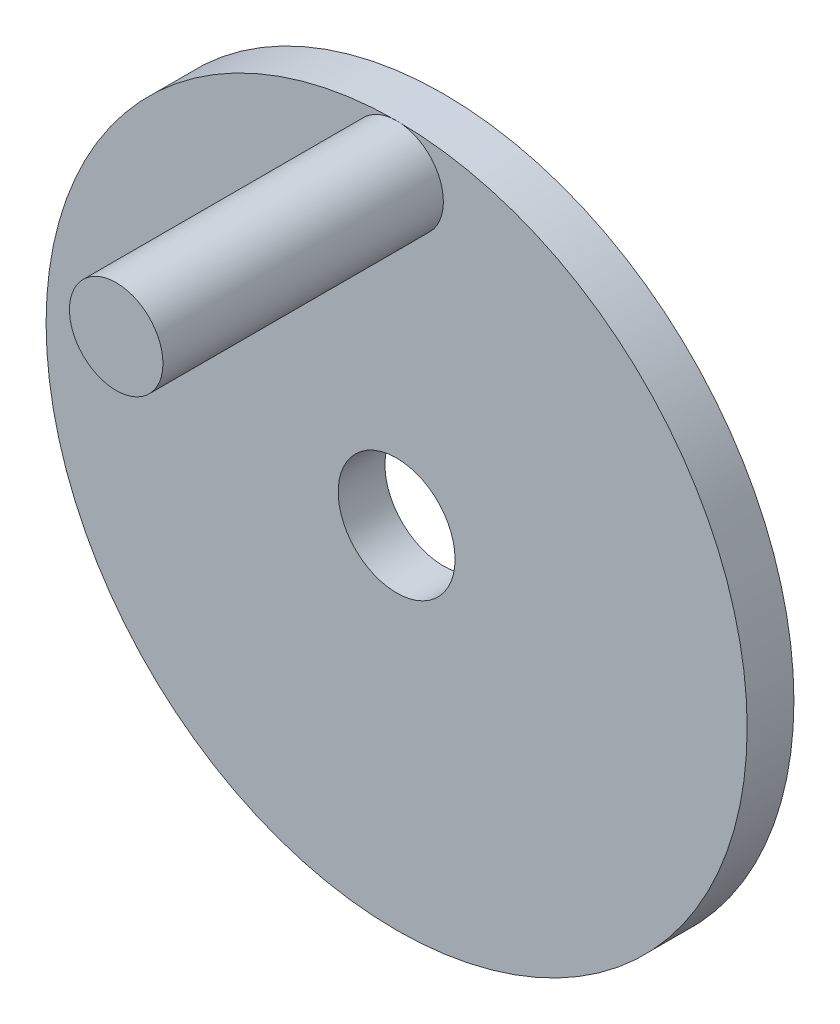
from build123d import *

# Parameters (mm, degrees)
SKETCH1_R           = 19.05
BOSS_EXTRUDE1_DEPTH = 2.54
SKETCH2_R           = 2.54
BOSS_EXTRUDE2_DEPTH = 15.24
SKETCH3_R           = 3.175
CUT_EXTRUDE1_DEPTH  = 31.952586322


with BuildPart() as part:
    # Sketch1 → Boss-Extrude1 (new body)
    with BuildSketch(Plane.XY):
        Circle(SKETCH1_R)
    extrude(amount=BOSS_EXTRUDE1_DEPTH)

    # Sketch2 → Boss-Extrude2 (add)
    with BuildSketch(Plane.XY.offset(2.54)):
        with Locations(Location((0, 16.51, 0), (0, 0, 90))):
            Circle(SKETCH2_R)
    extrude(amount=BOSS_EXTRUDE2_DEPTH)

    # Sketch3 → Cut-Extrude1 (cut, through all)
    with BuildSketch(Plane.XY.offset(2.54)):
        Circle(SKETCH3_R)
    extrude(amount=-CUT_EXTRUDE1_DEPTH, mode=Mode.SUBTRACT)


solid = part.part
